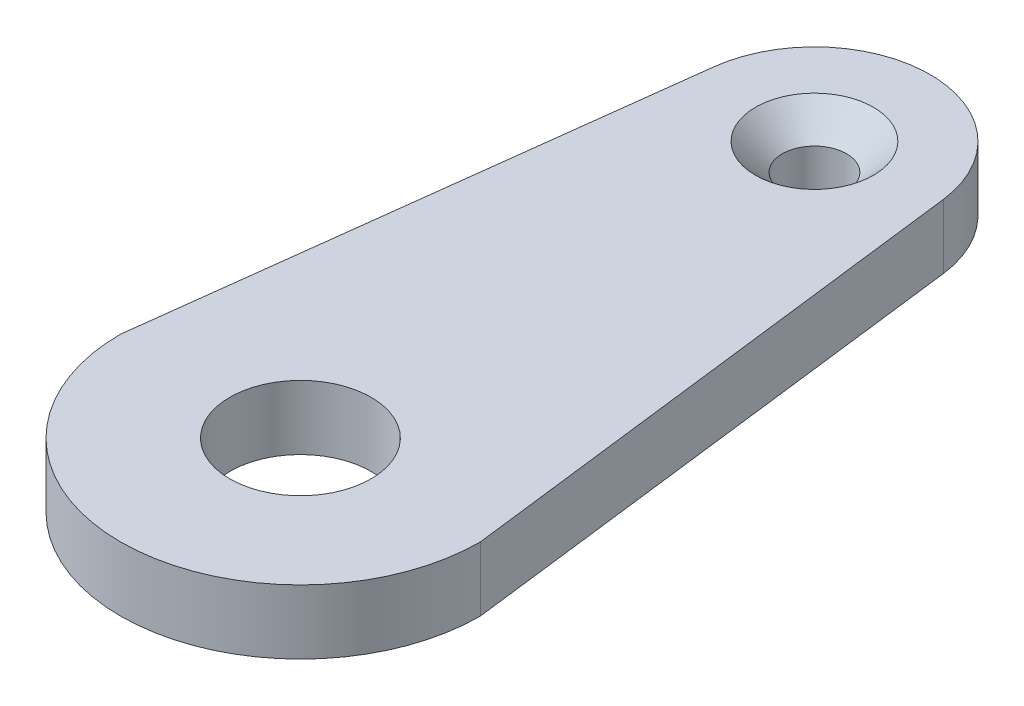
ISO-10303-21;
HEADER;
FILE_DESCRIPTION(('STEP AP214'),'2;1');
FILE_NAME('part.step','',(''),(''),'','','');
FILE_SCHEMA(('AUTOMOTIVE_DESIGN { 1 0 10303 214 1 1 1 1 }'));
ENDSEC;
DATA;
#1=APPLICATION_CONTEXT('core data for automotive mechanical design processes');
#2=APPLICATION_PROTOCOL_DEFINITION('international standard','automotive_design',2000,#1);
#3=PRODUCT_CONTEXT('',#1,'mechanical');
#4=PRODUCT('Part','Part','',(#3));
#5=PRODUCT_RELATED_PRODUCT_CATEGORY('part','',(#4));
#6=PRODUCT_DEFINITION_FORMATION('','',#4);
#7=PRODUCT_DEFINITION_CONTEXT('part definition',#1,'design');
#8=PRODUCT_DEFINITION('design','',#6,#7);
#9=PRODUCT_DEFINITION_SHAPE('','',#8);
#10=(LENGTH_UNIT() NAMED_UNIT(*) SI_UNIT(.MILLI.,.METRE.));
#11=(NAMED_UNIT(*) PLANE_ANGLE_UNIT() SI_UNIT($,.RADIAN.));
#12=(NAMED_UNIT(*) SI_UNIT($,.STERADIAN.) SOLID_ANGLE_UNIT());
#13=UNCERTAINTY_MEASURE_WITH_UNIT(LENGTH_MEASURE(1.E-05),#10,'distance_accuracy_value','');
#14=(GEOMETRIC_REPRESENTATION_CONTEXT(3) GLOBAL_UNCERTAINTY_ASSIGNED_CONTEXT((#13)) GLOBAL_UNIT_ASSIGNED_CONTEXT((#10,
#11,#12)) REPRESENTATION_CONTEXT('',''));
#15=CARTESIAN_POINT('',(0.,0.,0.));
#16=DIRECTION('',(0.,0.,1.));
#17=DIRECTION('',(1.,0.,0.));
#18=AXIS2_PLACEMENT_3D('',#15,#16,#17);
#19=CARTESIAN_POINT('',(0.,5.,0.));
#20=DIRECTION('',(0.,1.,0.));
#21=DIRECTION('',(0.,0.,1.));
#22=AXIS2_PLACEMENT_3D('',#19,#20,#21);
#23=PLANE('',#22);
#24=CARTESIAN_POINT('',(0.,5.,-40.));
#25=DIRECTION('',(0.,1.,0.));
#26=DIRECTION('',(0.,0.,1.));
#27=AXIS2_PLACEMENT_3D('',#24,#25,#26);
#28=CIRCLE('',#27,4.59);
#29=CARTESIAN_POINT('',(0.,5.,-35.41));
#30=VERTEX_POINT('',#29);
#31=EDGE_CURVE('E101',#30,#30,#28,.T.);
#32=ORIENTED_EDGE('',*,*,#31,.F.);
#33=EDGE_LOOP('',(#32));
#34=FACE_BOUND('',#33,.T.);
#35=DIRECTION('',(0.122369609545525,0.,-0.992484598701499));
#36=VECTOR('',#35,1.);
#37=CARTESIAN_POINT('',(-13.7903595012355,5.,-1.70029933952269));
#38=LINE('',#37,#36);
#39=CARTESIAN_POINT('',(-14.,5.,0.));
#40=VERTEX_POINT('',#39);
#41=CARTESIAN_POINT('',(-8.93236138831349,5.,-41.1013264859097));
#42=VERTEX_POINT('',#41);
#43=EDGE_CURVE('E96',#40,#42,#38,.T.);
#44=ORIENTED_EDGE('',*,*,#43,.F.);
#45=CARTESIAN_POINT('',(0.,5.,0.));
#46=DIRECTION('',(0.,1.,0.));
#47=DIRECTION('',(0.,0.,1.));
#48=AXIS2_PLACEMENT_3D('',#45,#46,#47);
#49=CIRCLE('',#48,14.);
#50=CARTESIAN_POINT('',(14.,5.,0.));
#51=VERTEX_POINT('',#50);
#52=EDGE_CURVE('E117',#40,#51,#49,.T.);
#53=ORIENTED_EDGE('',*,*,#52,.T.);
#54=DIRECTION('',(-0.122369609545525,0.,-0.992484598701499));
#55=VECTOR('',#54,1.);
#56=CARTESIAN_POINT('',(13.7903595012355,5.,-1.70029933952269));
#57=LINE('',#56,#55);
#58=CARTESIAN_POINT('',(8.93236138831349,5.,-41.1013264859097));
#59=VERTEX_POINT('',#58);
#60=EDGE_CURVE('E98',#51,#59,#57,.T.);
#61=ORIENTED_EDGE('',*,*,#60,.T.);
#62=CARTESIAN_POINT('',(0.,5.,-40.));
#63=DIRECTION('',(0.,1.,0.));
#64=DIRECTION('',(0.,0.,1.));
#65=AXIS2_PLACEMENT_3D('',#62,#63,#64);
#66=CIRCLE('',#65,9.);
#67=EDGE_CURVE('E91',#59,#42,#66,.T.);
#68=ORIENTED_EDGE('',*,*,#67,.T.);
#69=EDGE_LOOP('',(#44,#53,#61,#68));
#70=FACE_BOUND('',#69,.T.);
#71=CARTESIAN_POINT('',(0.,5.,0.));
#72=DIRECTION('',(0.,1.,0.));
#73=DIRECTION('',(0.,0.,1.));
#74=AXIS2_PLACEMENT_3D('',#71,#72,#73);
#75=CIRCLE('',#74,5.5);
#76=CARTESIAN_POINT('',(0.,5.,5.5));
#77=VERTEX_POINT('',#76);
#78=EDGE_CURVE('E108',#77,#77,#75,.T.);
#79=ORIENTED_EDGE('',*,*,#78,.F.);
#80=EDGE_LOOP('',(#79));
#81=FACE_BOUND('',#80,.T.);
#82=ADVANCED_FACE('F37',(#34,#70,#81),#23,.T.);
#83=CARTESIAN_POINT('',(0.,0.,0.));
#84=DIRECTION('',(0.,1.,0.));
#85=DIRECTION('',(0.,0.,1.));
#86=AXIS2_PLACEMENT_3D('',#83,#84,#85);
#87=PLANE('',#86);
#88=CARTESIAN_POINT('',(0.,0.,0.));
#89=DIRECTION('',(0.,1.,0.));
#90=DIRECTION('',(0.,0.,1.));
#91=AXIS2_PLACEMENT_3D('',#88,#89,#90);
#92=CIRCLE('',#91,14.);
#93=CARTESIAN_POINT('',(-14.,0.,0.));
#94=VERTEX_POINT('',#93);
#95=CARTESIAN_POINT('',(14.,0.,0.));
#96=VERTEX_POINT('',#95);
#97=EDGE_CURVE('E116',#94,#96,#92,.T.);
#98=ORIENTED_EDGE('',*,*,#97,.F.);
#99=DIRECTION('',(0.122369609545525,0.,-0.992484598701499));
#100=VECTOR('',#99,1.);
#101=CARTESIAN_POINT('',(-13.7903595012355,0.,-1.70029933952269));
#102=LINE('',#101,#100);
#103=CARTESIAN_POINT('',(-8.93236138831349,0.,-41.1013264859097));
#104=VERTEX_POINT('',#103);
#105=EDGE_CURVE('E53',#94,#104,#102,.T.);
#106=ORIENTED_EDGE('',*,*,#105,.T.);
#107=CARTESIAN_POINT('',(0.,0.,-40.));
#108=DIRECTION('',(0.,1.,0.));
#109=DIRECTION('',(0.,0.,1.));
#110=AXIS2_PLACEMENT_3D('',#107,#108,#109);
#111=CIRCLE('',#110,9.);
#112=CARTESIAN_POINT('',(8.93236138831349,0.,-41.1013264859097));
#113=VERTEX_POINT('',#112);
#114=EDGE_CURVE('E62',#113,#104,#111,.T.);
#115=ORIENTED_EDGE('',*,*,#114,.F.);
#116=DIRECTION('',(-0.122369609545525,0.,-0.992484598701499));
#117=VECTOR('',#116,1.);
#118=CARTESIAN_POINT('',(13.7903595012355,0.,-1.70029933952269));
#119=LINE('',#118,#117);
#120=EDGE_CURVE('E81',#96,#113,#119,.T.);
#121=ORIENTED_EDGE('',*,*,#120,.F.);
#122=EDGE_LOOP('',(#98,#106,#115,#121));
#123=FACE_BOUND('',#122,.T.);
#124=CARTESIAN_POINT('',(0.,0.,-40.));
#125=DIRECTION('',(0.,1.,0.));
#126=DIRECTION('',(0.,0.,1.));
#127=AXIS2_PLACEMENT_3D('',#124,#125,#126);
#128=CIRCLE('',#127,2.5);
#129=CARTESIAN_POINT('',(0.,0.,-37.5));
#130=VERTEX_POINT('',#129);
#131=EDGE_CURVE('E111',#130,#130,#128,.T.);
#132=ORIENTED_EDGE('',*,*,#131,.T.);
#133=EDGE_LOOP('',(#132));
#134=FACE_BOUND('',#133,.T.);
#135=CARTESIAN_POINT('',(0.,0.,0.));
#136=DIRECTION('',(0.,1.,0.));
#137=DIRECTION('',(0.,0.,1.));
#138=AXIS2_PLACEMENT_3D('',#135,#136,#137);
#139=CIRCLE('',#138,5.5);
#140=CARTESIAN_POINT('',(0.,0.,5.5));
#141=VERTEX_POINT('',#140);
#142=EDGE_CURVE('E106',#141,#141,#139,.T.);
#143=ORIENTED_EDGE('',*,*,#142,.T.);
#144=EDGE_LOOP('',(#143));
#145=FACE_BOUND('',#144,.T.);
#146=ADVANCED_FACE('F94',(#123,#134,#145),#87,.F.);
#147=CARTESIAN_POINT('',(0.,5.,0.));
#148=DIRECTION('',(0.,-1.,0.));
#149=DIRECTION('',(0.,0.,-1.));
#150=AXIS2_PLACEMENT_3D('',#147,#148,#149);
#151=CYLINDRICAL_SURFACE('',#150,14.);
#152=ORIENTED_EDGE('',*,*,#97,.T.);
#153=DIRECTION('',(0.,-1.,0.));
#154=VECTOR('',#153,1.);
#155=CARTESIAN_POINT('',(14.,5.,0.));
#156=LINE('',#155,#154);
#157=EDGE_CURVE('E11',#51,#96,#156,.T.);
#158=ORIENTED_EDGE('',*,*,#157,.F.);
#159=ORIENTED_EDGE('',*,*,#52,.F.);
#160=DIRECTION('',(0.,-1.,0.));
#161=VECTOR('',#160,1.);
#162=CARTESIAN_POINT('',(-14.,5.,0.));
#163=LINE('',#162,#161);
#164=EDGE_CURVE('E46',#40,#94,#163,.T.);
#165=ORIENTED_EDGE('',*,*,#164,.T.);
#166=EDGE_LOOP('',(#152,#158,#159,#165));
#167=FACE_BOUND('',#166,.T.);
#168=ADVANCED_FACE('F39',(#167),#151,.T.);
#169=CARTESIAN_POINT('',(0.,5.,-40.));
#170=DIRECTION('',(0.,-1.,0.));
#171=DIRECTION('',(0.,0.,-1.));
#172=AXIS2_PLACEMENT_3D('',#169,#170,#171);
#173=CYLINDRICAL_SURFACE('',#172,2.5);
#174=CARTESIAN_POINT('',(0.,2.91,-40.));
#175=DIRECTION('',(0.,1.,0.));
#176=DIRECTION('',(0.,0.,1.));
#177=AXIS2_PLACEMENT_3D('',#174,#175,#176);
#178=CIRCLE('',#177,2.5);
#179=CARTESIAN_POINT('',(0.,2.91,-37.5));
#180=VERTEX_POINT('',#179);
#181=EDGE_CURVE('E41',#180,#180,#178,.F.);
#182=ORIENTED_EDGE('',*,*,#181,.F.);
#183=EDGE_LOOP('',(#182));
#184=FACE_BOUND('',#183,.T.);
#185=ORIENTED_EDGE('',*,*,#131,.F.);
#186=EDGE_LOOP('',(#185));
#187=FACE_BOUND('',#186,.T.);
#188=ADVANCED_FACE('F135',(#184,#187),#173,.F.);
#189=CARTESIAN_POINT('',(0.,5.,0.));
#190=DIRECTION('',(0.,-1.,0.));
#191=DIRECTION('',(0.,0.,-1.));
#192=AXIS2_PLACEMENT_3D('',#189,#190,#191);
#193=CYLINDRICAL_SURFACE('',#192,5.5);
#194=ORIENTED_EDGE('',*,*,#78,.T.);
#195=EDGE_LOOP('',(#194));
#196=FACE_BOUND('',#195,.T.);
#197=ORIENTED_EDGE('',*,*,#142,.F.);
#198=EDGE_LOOP('',(#197));
#199=FACE_BOUND('',#198,.T.);
#200=ADVANCED_FACE('F132',(#196,#199),#193,.F.);
#201=CARTESIAN_POINT('',(0.,0.,-40.));
#202=DIRECTION('',(0.,1.,0.));
#203=DIRECTION('',(0.,0.,1.));
#204=AXIS2_PLACEMENT_3D('',#201,#202,#203);
#205=CYLINDRICAL_SURFACE('',#204,9.);
#206=ORIENTED_EDGE('',*,*,#67,.F.);
#207=DIRECTION('',(0.,1.,0.));
#208=VECTOR('',#207,1.);
#209=CARTESIAN_POINT('',(8.93236138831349,0.,-41.1013264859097));
#210=LINE('',#209,#208);
#211=EDGE_CURVE('E83',#113,#59,#210,.T.);
#212=ORIENTED_EDGE('',*,*,#211,.F.);
#213=ORIENTED_EDGE('',*,*,#114,.T.);
#214=DIRECTION('',(0.,1.,0.));
#215=VECTOR('',#214,1.);
#216=CARTESIAN_POINT('',(-8.93236138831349,0.,-41.1013264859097));
#217=LINE('',#216,#215);
#218=EDGE_CURVE('E76',#104,#42,#217,.T.);
#219=ORIENTED_EDGE('',*,*,#218,.T.);
#220=EDGE_LOOP('',(#206,#212,#213,#219));
#221=FACE_BOUND('',#220,.T.);
#222=ADVANCED_FACE('F89',(#221),#205,.T.);
#223=CARTESIAN_POINT('',(-13.7903595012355,0.,-1.70029933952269));
#224=DIRECTION('',(0.992484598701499,0.,0.122369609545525));
#225=DIRECTION('',(0.122369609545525,0.,-0.992484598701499));
#226=AXIS2_PLACEMENT_3D('',#223,#224,#225);
#227=PLANE('',#226);
#228=ORIENTED_EDGE('',*,*,#43,.T.);
#229=ORIENTED_EDGE('',*,*,#218,.F.);
#230=ORIENTED_EDGE('',*,*,#105,.F.);
#231=ORIENTED_EDGE('',*,*,#164,.F.);
#232=EDGE_LOOP('',(#228,#229,#230,#231));
#233=FACE_BOUND('',#232,.T.);
#234=ADVANCED_FACE('F124',(#233),#227,.F.);
#235=CARTESIAN_POINT('',(13.7903595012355,0.,-1.70029933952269));
#236=DIRECTION('',(0.992484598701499,0.,-0.122369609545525));
#237=DIRECTION('',(-0.122369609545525,0.,-0.992484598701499));
#238=AXIS2_PLACEMENT_3D('',#235,#236,#237);
#239=PLANE('',#238);
#240=ORIENTED_EDGE('',*,*,#60,.F.);
#241=ORIENTED_EDGE('',*,*,#157,.T.);
#242=ORIENTED_EDGE('',*,*,#120,.T.);
#243=ORIENTED_EDGE('',*,*,#211,.T.);
#244=EDGE_LOOP('',(#240,#241,#242,#243));
#245=FACE_BOUND('',#244,.T.);
#246=ADVANCED_FACE('F82',(#245),#239,.T.);
#247=CARTESIAN_POINT('',(0.,5.,-40.));
#248=DIRECTION('',(0.,1.,0.));
#249=DIRECTION('',(0.,0.,1.));
#250=AXIS2_PLACEMENT_3D('',#247,#248,#249);
#251=CONICAL_SURFACE('',#250,4.59,0.785398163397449);
#252=ORIENTED_EDGE('',*,*,#181,.T.);
#253=EDGE_LOOP('',(#252));
#254=FACE_BOUND('',#253,.T.);
#255=ORIENTED_EDGE('',*,*,#31,.T.);
#256=EDGE_LOOP('',(#255));
#257=FACE_BOUND('',#256,.T.);
#258=ADVANCED_FACE('F151',(#254,#257),#251,.F.);
#259=CLOSED_SHELL('',(#82,#146,#168,#188,#200,#222,#234,#246,#258));
#260=MANIFOLD_SOLID_BREP('B2',#259);
#261=ADVANCED_BREP_SHAPE_REPRESENTATION('',(#18,#260),#14);
#262=SHAPE_DEFINITION_REPRESENTATION(#9,#261);
ENDSEC;
END-ISO-10303-21;
